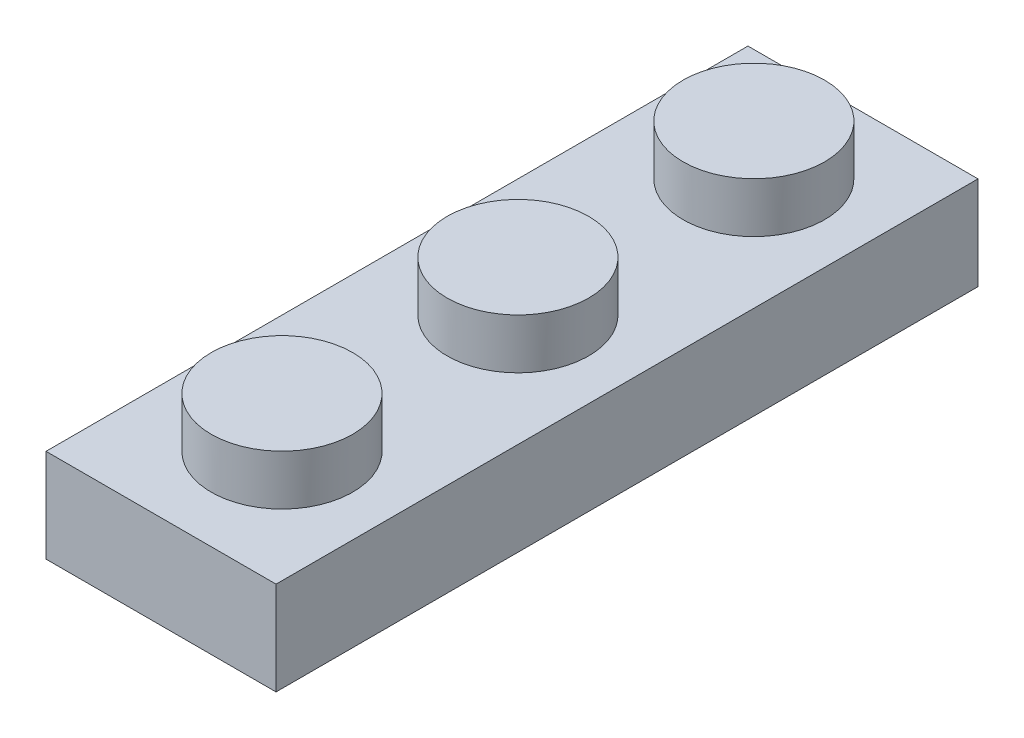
from build123d import *

# Parameters (mm, degrees)
SKETCH1_W                 = 7.8
SKETCH1_H                 = 23.8
EXTRUDE1_DEPTH            = 3.166
SKETCH2_R                 = 2.4
EXTRUDE2_DEPTH            = 1.7
SKETCH3_W                 = 4.9
SKETCH3_H                 = 4.9
EXTRUDE3_DEPTH            = 2.5
LPATTERN1_COUNT           = 2
LPATTERN1_PITCH           = 8
LPATTERN2_COUNT           = 2
LPATTERN2_PITCH           = 8
LPATTERN3_COUNT           = 3
LPATTERN3_PITCH           = 8
LPATTERN4_COPY_1_SKETCH_W = 4.9
LPATTERN4_COPY_1_SKETCH_H = 4.9
LPATTERN4_COPY_1_DEPTH    = 2.5
LPATTERN4_COPY_2_SKETCH_W = 4.9
LPATTERN4_COPY_2_SKETCH_H = 4.9
LPATTERN4_COPY_2_DEPTH    = 2.5


with BuildPart() as part:
    # Sketch1 → Extrude1 (new body)
    with BuildSketch(Plane(origin=(0, 0, 0), x_dir=(1, 0, 0), z_dir=(0, 1, 0))):
        with Locations((3.9, 11.9)):
            Rectangle(SKETCH1_W, SKETCH1_H)
    extrude(amount=EXTRUDE1_DEPTH)

    # Sketch2 → Extrude2 (add)
    with BuildSketch(Plane(origin=(0, 3.166, 0), x_dir=(1, 0, 0), z_dir=(0, 1, 0))):
        with Locations(Location((4, 4, 0), (0, 0, 90))):
            Circle(SKETCH2_R)
    extrude2 = extrude(amount=EXTRUDE2_DEPTH)

    # Sketch3 → Extrude3 (cut)
    with BuildSketch(Plane.XZ):
        with Locations((3.9, -19.9)):
            Rectangle(SKETCH3_W, SKETCH3_H)
    extrude3 = extrude(amount=-EXTRUDE3_DEPTH, mode=Mode.SUBTRACT)

    # LPattern1: Extrude2 ×2
    with Locations(*[(0, 0, -i * LPATTERN1_PITCH) for i in range(1, LPATTERN1_COUNT)]):
        add(extrude2)

    # LPattern2: Extrude3 ×2
    with Locations(*[(0, 0, i * LPATTERN2_PITCH) for i in range(1, LPATTERN2_COUNT)]):
        add(extrude3, mode=Mode.SUBTRACT)

    # LPattern3: Extrude2 ×3
    with Locations(*[(0, 0, -i * LPATTERN3_PITCH) for i in range(1, LPATTERN3_COUNT)]):
        add(extrude2)

    # LPattern4 copy 1 sketch → LPattern4 copy 1 (cut)
    with BuildSketch(Plane(origin=(0, 0, 16), x_dir=(1, 0, 0), z_dir=(0, -1, 0))):
        with Locations((3.9, -19.9)):
            Rectangle(LPATTERN4_COPY_1_SKETCH_W, LPATTERN4_COPY_1_SKETCH_H)
    extrude(amount=-LPATTERN4_COPY_1_DEPTH, mode=Mode.SUBTRACT)

    # LPattern4 copy 2 sketch → LPattern4 copy 2 (cut)
    with BuildSketch(Plane(origin=(0, 0, 8), x_dir=(1, 0, 0), z_dir=(0, -1, 0))):
        with Locations((3.9, -19.9)):
            Rectangle(LPATTERN4_COPY_2_SKETCH_W, LPATTERN4_COPY_2_SKETCH_H)
    extrude(amount=-LPATTERN4_COPY_2_DEPTH, mode=Mode.SUBTRACT)


solid = part.part
